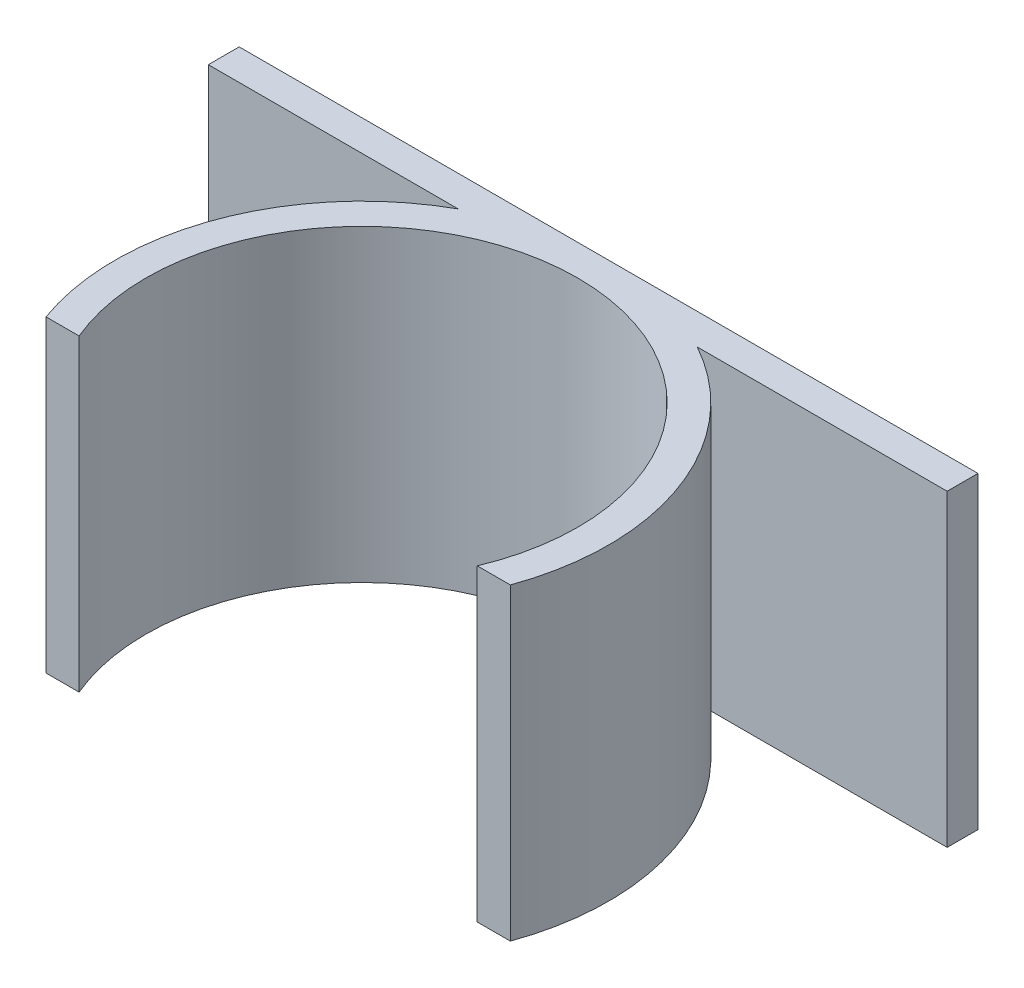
ISO-10303-21;
HEADER;
FILE_DESCRIPTION(('STEP AP214'),'2;1');
FILE_NAME('part.step','',(''),(''),'','','');
FILE_SCHEMA(('AUTOMOTIVE_DESIGN { 1 0 10303 214 1 1 1 1 }'));
ENDSEC;
DATA;
#1=APPLICATION_CONTEXT('core data for automotive mechanical design processes');
#2=APPLICATION_PROTOCOL_DEFINITION('international standard','automotive_design',2000,#1);
#3=PRODUCT_CONTEXT('',#1,'mechanical');
#4=PRODUCT('Part','Part','',(#3));
#5=PRODUCT_RELATED_PRODUCT_CATEGORY('part','',(#4));
#6=PRODUCT_DEFINITION_FORMATION('','',#4);
#7=PRODUCT_DEFINITION_CONTEXT('part definition',#1,'design');
#8=PRODUCT_DEFINITION('design','',#6,#7);
#9=PRODUCT_DEFINITION_SHAPE('','',#8);
#10=(LENGTH_UNIT() NAMED_UNIT(*) SI_UNIT(.MILLI.,.METRE.));
#11=(NAMED_UNIT(*) PLANE_ANGLE_UNIT() SI_UNIT($,.RADIAN.));
#12=(NAMED_UNIT(*) SI_UNIT($,.STERADIAN.) SOLID_ANGLE_UNIT());
#13=UNCERTAINTY_MEASURE_WITH_UNIT(LENGTH_MEASURE(1.E-05),#10,'distance_accuracy_value','');
#14=(GEOMETRIC_REPRESENTATION_CONTEXT(3) GLOBAL_UNCERTAINTY_ASSIGNED_CONTEXT((#13)) GLOBAL_UNIT_ASSIGNED_CONTEXT((#10,
#11,#12)) REPRESENTATION_CONTEXT('',''));
#15=CARTESIAN_POINT('',(0.,0.,0.));
#16=DIRECTION('',(0.,0.,1.));
#17=DIRECTION('',(1.,0.,0.));
#18=AXIS2_PLACEMENT_3D('',#15,#16,#17);
#19=CARTESIAN_POINT('',(0.,10.,0.));
#20=DIRECTION('',(0.,-1.,0.));
#21=DIRECTION('',(0.,0.,-1.));
#22=AXIS2_PLACEMENT_3D('',#19,#20,#21);
#23=CYLINDRICAL_SURFACE('',#22,8.);
#24=CARTESIAN_POINT('',(0.,0.,0.));
#25=DIRECTION('',(0.,1.,0.));
#26=DIRECTION('',(0.,0.,1.));
#27=AXIS2_PLACEMENT_3D('',#24,#25,#26);
#28=CIRCLE('',#27,8.);
#29=CARTESIAN_POINT('',(-3.87298334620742,0.,-7.));
#30=VERTEX_POINT('',#29);
#31=CARTESIAN_POINT('',(-7.52651740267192,0.,2.71137156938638));
#32=VERTEX_POINT('',#31);
#33=EDGE_CURVE('E136',#30,#32,#28,.T.);
#34=ORIENTED_EDGE('',*,*,#33,.T.);
#35=DIRECTION('',(0.,-1.,0.));
#36=VECTOR('',#35,1.);
#37=CARTESIAN_POINT('',(-7.52651740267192,10.,2.71137156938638));
#38=LINE('',#37,#36);
#39=CARTESIAN_POINT('',(-7.52651740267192,10.,2.71137156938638));
#40=VERTEX_POINT('',#39);
#41=EDGE_CURVE('E120',#32,#40,#38,.F.);
#42=ORIENTED_EDGE('',*,*,#41,.T.);
#43=CARTESIAN_POINT('',(0.,10.,0.));
#44=DIRECTION('',(0.,1.,0.));
#45=DIRECTION('',(0.,0.,1.));
#46=AXIS2_PLACEMENT_3D('',#43,#44,#45);
#47=CIRCLE('',#46,8.);
#48=CARTESIAN_POINT('',(-3.87298334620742,10.,-7.));
#49=VERTEX_POINT('',#48);
#50=EDGE_CURVE('E135',#49,#40,#47,.T.);
#51=ORIENTED_EDGE('',*,*,#50,.F.);
#52=DIRECTION('',(0.,-1.,0.));
#53=VECTOR('',#52,1.);
#54=CARTESIAN_POINT('',(-3.87298334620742,10.,-7.));
#55=LINE('',#54,#53);
#56=EDGE_CURVE('E154',#30,#49,#55,.F.);
#57=ORIENTED_EDGE('',*,*,#56,.F.);
#58=EDGE_LOOP('',(#34,#42,#51,#57));
#59=FACE_BOUND('',#58,.T.);
#60=ADVANCED_FACE('F39',(#59),#23,.T.);
#61=CARTESIAN_POINT('',(7.52651740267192,10.,2.71137156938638));
#62=VERTEX_POINT('',#61);
#63=CARTESIAN_POINT('',(3.87298334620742,10.,-7.));
#64=VERTEX_POINT('',#63);
#65=EDGE_CURVE('E125',#62,#64,#47,.T.);
#66=ORIENTED_EDGE('',*,*,#65,.F.);
#67=DIRECTION('',(0.,-1.,0.));
#68=VECTOR('',#67,1.);
#69=CARTESIAN_POINT('',(7.52651740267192,10.,2.71137156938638));
#70=LINE('',#69,#68);
#71=CARTESIAN_POINT('',(7.52651740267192,0.,2.71137156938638));
#72=VERTEX_POINT('',#71);
#73=EDGE_CURVE('E113',#62,#72,#70,.T.);
#74=ORIENTED_EDGE('',*,*,#73,.T.);
#75=CARTESIAN_POINT('',(3.87298334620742,0.,-7.));
#76=VERTEX_POINT('',#75);
#77=EDGE_CURVE('E140',#72,#76,#28,.T.);
#78=ORIENTED_EDGE('',*,*,#77,.T.);
#79=DIRECTION('',(0.,-1.,0.));
#80=VECTOR('',#79,1.);
#81=CARTESIAN_POINT('',(3.87298334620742,10.,-7.));
#82=LINE('',#81,#80);
#83=EDGE_CURVE('E133',#64,#76,#82,.T.);
#84=ORIENTED_EDGE('',*,*,#83,.F.);
#85=EDGE_LOOP('',(#66,#74,#78,#84));
#86=FACE_BOUND('',#85,.T.);
#87=ADVANCED_FACE('F41',(#86),#23,.T.);
#88=CARTESIAN_POINT('',(0.,10.,0.));
#89=DIRECTION('',(0.,1.,0.));
#90=DIRECTION('',(0.,0.,1.));
#91=AXIS2_PLACEMENT_3D('',#88,#89,#90);
#92=PLANE('',#91);
#93=DIRECTION('',(-1.,0.,0.));
#94=VECTOR('',#93,1.);
#95=CARTESIAN_POINT('',(-9.19682687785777,10.,2.71137156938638));
#96=LINE('',#95,#94);
#97=CARTESIAN_POINT('',(6.45356213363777,10.,2.71137156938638));
#98=VERTEX_POINT('',#97);
#99=EDGE_CURVE('E61',#62,#98,#96,.T.);
#100=ORIENTED_EDGE('',*,*,#99,.F.);
#101=ORIENTED_EDGE('',*,*,#65,.T.);
#102=DIRECTION('',(1.,0.,0.));
#103=VECTOR('',#102,1.);
#104=CARTESIAN_POINT('',(-11.9753257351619,10.,-7.));
#105=LINE('',#104,#103);
#106=CARTESIAN_POINT('',(11.9753257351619,10.,-7.));
#107=VERTEX_POINT('',#106);
#108=EDGE_CURVE('E189',#64,#107,#105,.T.);
#109=ORIENTED_EDGE('',*,*,#108,.T.);
#110=DIRECTION('',(0.,0.,1.));
#111=VECTOR('',#110,1.);
#112=CARTESIAN_POINT('',(11.9753257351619,10.,-8.));
#113=LINE('',#112,#111);
#114=CARTESIAN_POINT('',(11.9753257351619,10.,-8.));
#115=VERTEX_POINT('',#114);
#116=EDGE_CURVE('E184',#115,#107,#113,.T.);
#117=ORIENTED_EDGE('',*,*,#116,.F.);
#118=DIRECTION('',(1.,0.,0.));
#119=VECTOR('',#118,1.);
#120=CARTESIAN_POINT('',(-11.9753257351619,10.,-8.));
#121=LINE('',#120,#119);
#122=CARTESIAN_POINT('',(-11.9753257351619,10.,-8.));
#123=VERTEX_POINT('',#122);
#124=EDGE_CURVE('E169',#123,#115,#121,.T.);
#125=ORIENTED_EDGE('',*,*,#124,.F.);
#126=DIRECTION('',(0.,0.,1.));
#127=VECTOR('',#126,1.);
#128=CARTESIAN_POINT('',(-11.9753257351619,10.,-8.));
#129=LINE('',#128,#127);
#130=CARTESIAN_POINT('',(-11.9753257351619,10.,-7.));
#131=VERTEX_POINT('',#130);
#132=EDGE_CURVE('E172',#123,#131,#129,.T.);
#133=ORIENTED_EDGE('',*,*,#132,.T.);
#134=EDGE_CURVE('E187',#131,#49,#105,.T.);
#135=ORIENTED_EDGE('',*,*,#134,.T.);
#136=ORIENTED_EDGE('',*,*,#50,.T.);
#137=CARTESIAN_POINT('',(-6.45356213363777,10.,2.71137156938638));
#138=VERTEX_POINT('',#137);
#139=EDGE_CURVE('E130',#138,#40,#96,.T.);
#140=ORIENTED_EDGE('',*,*,#139,.F.);
#141=CARTESIAN_POINT('',(0.,10.,0.));
#142=DIRECTION('',(0.,1.,0.));
#143=DIRECTION('',(0.,0.,1.));
#144=AXIS2_PLACEMENT_3D('',#141,#142,#143);
#145=CIRCLE('',#144,7.);
#146=EDGE_CURVE('E129',#98,#138,#145,.T.);
#147=ORIENTED_EDGE('',*,*,#146,.F.);
#148=EDGE_LOOP('',(#100,#101,#109,#117,#125,#133,#135,#136,#140,#147));
#149=FACE_BOUND('',#148,.T.);
#150=ADVANCED_FACE('F124',(#149),#92,.T.);
#151=CARTESIAN_POINT('',(0.,0.,0.));
#152=DIRECTION('',(0.,1.,0.));
#153=DIRECTION('',(0.,0.,1.));
#154=AXIS2_PLACEMENT_3D('',#151,#152,#153);
#155=PLANE('',#154);
#156=ORIENTED_EDGE('',*,*,#77,.F.);
#157=DIRECTION('',(-1.,0.,0.));
#158=VECTOR('',#157,1.);
#159=CARTESIAN_POINT('',(-9.19682687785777,0.,2.71137156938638));
#160=LINE('',#159,#158);
#161=CARTESIAN_POINT('',(6.45356213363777,0.,2.71137156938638));
#162=VERTEX_POINT('',#161);
#163=EDGE_CURVE('E116',#72,#162,#160,.T.);
#164=ORIENTED_EDGE('',*,*,#163,.T.);
#165=CARTESIAN_POINT('',(0.,0.,0.));
#166=DIRECTION('',(0.,1.,0.));
#167=DIRECTION('',(0.,0.,1.));
#168=AXIS2_PLACEMENT_3D('',#165,#166,#167);
#169=CIRCLE('',#168,7.);
#170=CARTESIAN_POINT('',(-6.45356213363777,0.,2.71137156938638));
#171=VERTEX_POINT('',#170);
#172=EDGE_CURVE('E143',#162,#171,#169,.T.);
#173=ORIENTED_EDGE('',*,*,#172,.T.);
#174=EDGE_CURVE('E54',#171,#32,#160,.T.);
#175=ORIENTED_EDGE('',*,*,#174,.T.);
#176=ORIENTED_EDGE('',*,*,#33,.F.);
#177=DIRECTION('',(1.,0.,0.));
#178=VECTOR('',#177,1.);
#179=CARTESIAN_POINT('',(-11.9753257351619,0.,-7.));
#180=LINE('',#179,#178);
#181=CARTESIAN_POINT('',(-11.9753257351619,0.,-7.));
#182=VERTEX_POINT('',#181);
#183=EDGE_CURVE('E176',#182,#30,#180,.T.);
#184=ORIENTED_EDGE('',*,*,#183,.F.);
#185=DIRECTION('',(0.,0.,1.));
#186=VECTOR('',#185,1.);
#187=CARTESIAN_POINT('',(-11.9753257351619,0.,-8.));
#188=LINE('',#187,#186);
#189=CARTESIAN_POINT('',(-11.9753257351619,0.,-8.));
#190=VERTEX_POINT('',#189);
#191=EDGE_CURVE('E180',#190,#182,#188,.T.);
#192=ORIENTED_EDGE('',*,*,#191,.F.);
#193=DIRECTION('',(1.,0.,0.));
#194=VECTOR('',#193,1.);
#195=CARTESIAN_POINT('',(-11.9753257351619,0.,-8.));
#196=LINE('',#195,#194);
#197=CARTESIAN_POINT('',(11.9753257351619,0.,-8.));
#198=VERTEX_POINT('',#197);
#199=EDGE_CURVE('E170',#190,#198,#196,.T.);
#200=ORIENTED_EDGE('',*,*,#199,.T.);
#201=DIRECTION('',(0.,0.,1.));
#202=VECTOR('',#201,1.);
#203=CARTESIAN_POINT('',(11.9753257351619,0.,-8.));
#204=LINE('',#203,#202);
#205=CARTESIAN_POINT('',(11.9753257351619,0.,-7.));
#206=VERTEX_POINT('',#205);
#207=EDGE_CURVE('E173',#198,#206,#204,.T.);
#208=ORIENTED_EDGE('',*,*,#207,.T.);
#209=EDGE_CURVE('E179',#76,#206,#180,.T.);
#210=ORIENTED_EDGE('',*,*,#209,.F.);
#211=EDGE_LOOP('',(#156,#164,#173,#175,#176,#184,#192,#200,#208,#210));
#212=FACE_BOUND('',#211,.T.);
#213=ADVANCED_FACE('F194',(#212),#155,.F.);
#214=CARTESIAN_POINT('',(0.,10.,0.));
#215=DIRECTION('',(0.,-1.,0.));
#216=DIRECTION('',(0.,0.,-1.));
#217=AXIS2_PLACEMENT_3D('',#214,#215,#216);
#218=CYLINDRICAL_SURFACE('',#217,7.);
#219=DIRECTION('',(0.,-1.,0.));
#220=VECTOR('',#219,1.);
#221=CARTESIAN_POINT('',(6.45356213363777,10.,2.71137156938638));
#222=LINE('',#221,#220);
#223=EDGE_CURVE('E11',#98,#162,#222,.T.);
#224=ORIENTED_EDGE('',*,*,#223,.F.);
#225=ORIENTED_EDGE('',*,*,#146,.T.);
#226=DIRECTION('',(0.,-1.,0.));
#227=VECTOR('',#226,1.);
#228=CARTESIAN_POINT('',(-6.45356213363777,10.,2.71137156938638));
#229=LINE('',#228,#227);
#230=EDGE_CURVE('E47',#171,#138,#229,.F.);
#231=ORIENTED_EDGE('',*,*,#230,.F.);
#232=ORIENTED_EDGE('',*,*,#172,.F.);
#233=EDGE_LOOP('',(#224,#225,#231,#232));
#234=FACE_BOUND('',#233,.T.);
#235=ADVANCED_FACE('F151',(#234),#218,.F.);
#236=CARTESIAN_POINT('',(-11.9753257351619,10.,-8.));
#237=DIRECTION('',(0.,0.,-1.));
#238=DIRECTION('',(-1.,0.,0.));
#239=AXIS2_PLACEMENT_3D('',#236,#237,#238);
#240=PLANE('',#239);
#241=ORIENTED_EDGE('',*,*,#199,.F.);
#242=DIRECTION('',(0.,-1.,0.));
#243=VECTOR('',#242,1.);
#244=CARTESIAN_POINT('',(-11.9753257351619,10.,-8.));
#245=LINE('',#244,#243);
#246=EDGE_CURVE('E166',#123,#190,#245,.T.);
#247=ORIENTED_EDGE('',*,*,#246,.F.);
#248=ORIENTED_EDGE('',*,*,#124,.T.);
#249=DIRECTION('',(0.,-1.,0.));
#250=VECTOR('',#249,1.);
#251=CARTESIAN_POINT('',(11.9753257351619,10.,-8.));
#252=LINE('',#251,#250);
#253=EDGE_CURVE('E163',#115,#198,#252,.T.);
#254=ORIENTED_EDGE('',*,*,#253,.T.);
#255=EDGE_LOOP('',(#241,#247,#248,#254));
#256=FACE_BOUND('',#255,.T.);
#257=ADVANCED_FACE('F206',(#256),#240,.T.);
#258=CARTESIAN_POINT('',(-11.9753257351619,10.,-7.));
#259=DIRECTION('',(0.,0.,-1.));
#260=DIRECTION('',(-1.,0.,0.));
#261=AXIS2_PLACEMENT_3D('',#258,#259,#260);
#262=PLANE('',#261);
#263=ORIENTED_EDGE('',*,*,#108,.F.);
#264=ORIENTED_EDGE('',*,*,#83,.T.);
#265=ORIENTED_EDGE('',*,*,#209,.T.);
#266=DIRECTION('',(0.,-1.,0.));
#267=VECTOR('',#266,1.);
#268=CARTESIAN_POINT('',(11.9753257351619,10.,-7.));
#269=LINE('',#268,#267);
#270=EDGE_CURVE('E160',#107,#206,#269,.T.);
#271=ORIENTED_EDGE('',*,*,#270,.F.);
#272=EDGE_LOOP('',(#263,#264,#265,#271));
#273=FACE_BOUND('',#272,.T.);
#274=ADVANCED_FACE('F197',(#273),#262,.F.);
#275=ORIENTED_EDGE('',*,*,#183,.T.);
#276=ORIENTED_EDGE('',*,*,#56,.T.);
#277=ORIENTED_EDGE('',*,*,#134,.F.);
#278=DIRECTION('',(0.,-1.,0.));
#279=VECTOR('',#278,1.);
#280=CARTESIAN_POINT('',(-11.9753257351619,10.,-7.));
#281=LINE('',#280,#279);
#282=EDGE_CURVE('E157',#131,#182,#281,.T.);
#283=ORIENTED_EDGE('',*,*,#282,.T.);
#284=EDGE_LOOP('',(#275,#276,#277,#283));
#285=FACE_BOUND('',#284,.T.);
#286=ADVANCED_FACE('F213',(#285),#262,.F.);
#287=CARTESIAN_POINT('',(-11.9753257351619,10.,-8.));
#288=DIRECTION('',(1.,0.,0.));
#289=DIRECTION('',(0.,0.,-1.));
#290=AXIS2_PLACEMENT_3D('',#287,#288,#289);
#291=PLANE('',#290);
#292=ORIENTED_EDGE('',*,*,#191,.T.);
#293=ORIENTED_EDGE('',*,*,#282,.F.);
#294=ORIENTED_EDGE('',*,*,#132,.F.);
#295=ORIENTED_EDGE('',*,*,#246,.T.);
#296=EDGE_LOOP('',(#292,#293,#294,#295));
#297=FACE_BOUND('',#296,.T.);
#298=ADVANCED_FACE('F211',(#297),#291,.F.);
#299=CARTESIAN_POINT('',(11.9753257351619,10.,-8.));
#300=DIRECTION('',(1.,0.,0.));
#301=DIRECTION('',(0.,0.,-1.));
#302=AXIS2_PLACEMENT_3D('',#299,#300,#301);
#303=PLANE('',#302);
#304=ORIENTED_EDGE('',*,*,#207,.F.);
#305=ORIENTED_EDGE('',*,*,#253,.F.);
#306=ORIENTED_EDGE('',*,*,#116,.T.);
#307=ORIENTED_EDGE('',*,*,#270,.T.);
#308=EDGE_LOOP('',(#304,#305,#306,#307));
#309=FACE_BOUND('',#308,.T.);
#310=ADVANCED_FACE('F204',(#309),#303,.T.);
#311=CARTESIAN_POINT('',(-9.19682687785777,0.,2.71137156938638));
#312=DIRECTION('',(0.,0.,-1.));
#313=DIRECTION('',(-1.,0.,0.));
#314=AXIS2_PLACEMENT_3D('',#311,#312,#313);
#315=PLANE('',#314);
#316=ORIENTED_EDGE('',*,*,#174,.F.);
#317=ORIENTED_EDGE('',*,*,#230,.T.);
#318=ORIENTED_EDGE('',*,*,#139,.T.);
#319=ORIENTED_EDGE('',*,*,#41,.F.);
#320=EDGE_LOOP('',(#316,#317,#318,#319));
#321=FACE_BOUND('',#320,.T.);
#322=ADVANCED_FACE('F145',(#321),#315,.F.);
#323=ORIENTED_EDGE('',*,*,#99,.T.);
#324=ORIENTED_EDGE('',*,*,#223,.T.);
#325=ORIENTED_EDGE('',*,*,#163,.F.);
#326=ORIENTED_EDGE('',*,*,#73,.F.);
#327=EDGE_LOOP('',(#323,#324,#325,#326));
#328=FACE_BOUND('',#327,.T.);
#329=ADVANCED_FACE('F114',(#328),#315,.F.);
#330=CLOSED_SHELL('',(#60,#87,#150,#213,#235,#257,#274,#286,#298,#310,#322,#329));
#331=MANIFOLD_SOLID_BREP('B2',#330);
#332=ADVANCED_BREP_SHAPE_REPRESENTATION('',(#18,#331),#14);
#333=SHAPE_DEFINITION_REPRESENTATION(#9,#332);
ENDSEC;
END-ISO-10303-21;
